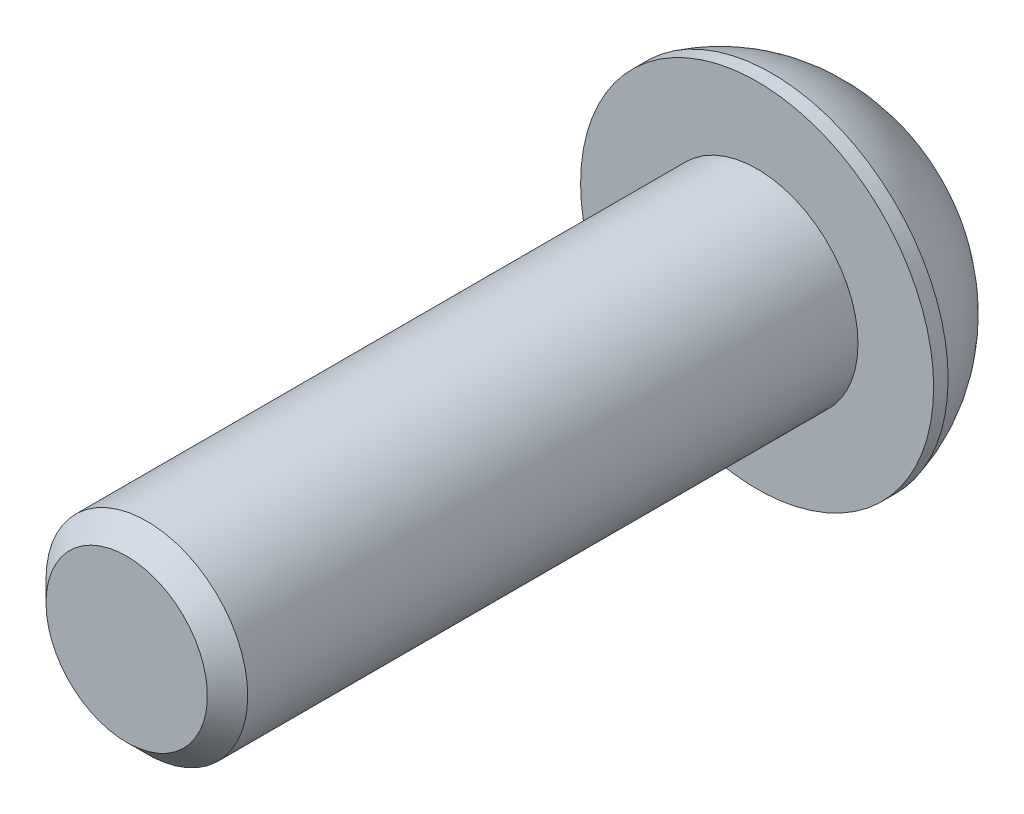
ISO-10303-21;
HEADER;
FILE_DESCRIPTION(('STEP AP214'),'2;1');
FILE_NAME('part.step','',(''),(''),'','','');
FILE_SCHEMA(('AUTOMOTIVE_DESIGN { 1 0 10303 214 1 1 1 1 }'));
ENDSEC;
DATA;
#1=APPLICATION_CONTEXT('core data for automotive mechanical design processes');
#2=APPLICATION_PROTOCOL_DEFINITION('international standard','automotive_design',2000,#1);
#3=PRODUCT_CONTEXT('',#1,'mechanical');
#4=PRODUCT('Part','Part','',(#3));
#5=PRODUCT_RELATED_PRODUCT_CATEGORY('part','',(#4));
#6=PRODUCT_DEFINITION_FORMATION('','',#4);
#7=PRODUCT_DEFINITION_CONTEXT('part definition',#1,'design');
#8=PRODUCT_DEFINITION('design','',#6,#7);
#9=PRODUCT_DEFINITION_SHAPE('','',#8);
#10=(LENGTH_UNIT() NAMED_UNIT(*) SI_UNIT(.MILLI.,.METRE.));
#11=(NAMED_UNIT(*) PLANE_ANGLE_UNIT() SI_UNIT($,.RADIAN.));
#12=(NAMED_UNIT(*) SI_UNIT($,.STERADIAN.) SOLID_ANGLE_UNIT());
#13=UNCERTAINTY_MEASURE_WITH_UNIT(LENGTH_MEASURE(1.E-05),#10,'distance_accuracy_value','');
#14=(GEOMETRIC_REPRESENTATION_CONTEXT(3) GLOBAL_UNCERTAINTY_ASSIGNED_CONTEXT((#13)) GLOBAL_UNIT_ASSIGNED_CONTEXT((#10,
#11,#12)) REPRESENTATION_CONTEXT('',''));
#15=CARTESIAN_POINT('',(0.,0.,0.));
#16=DIRECTION('',(0.,0.,1.));
#17=DIRECTION('',(1.,0.,0.));
#18=AXIS2_PLACEMENT_3D('',#15,#16,#17);
#19=CARTESIAN_POINT('',(0.,0.,-4.4));
#20=DIRECTION('',(0.,0.,1.));
#21=DIRECTION('',(1.,0.,0.));
#22=AXIS2_PLACEMENT_3D('',#19,#20,#21);
#23=PLANE('',#22);
#24=CARTESIAN_POINT('',(0.,0.,-4.4));
#25=DIRECTION('',(0.,0.,-1.));
#26=DIRECTION('',(-1.,0.,0.));
#27=AXIS2_PLACEMENT_3D('',#24,#25,#26);
#28=CIRCLE('',#27,4.06492341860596);
#29=CARTESIAN_POINT('',(-4.06492341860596,0.,-4.4));
#30=VERTEX_POINT('',#29);
#31=EDGE_CURVE('E147',#30,#30,#28,.T.);
#32=ORIENTED_EDGE('',*,*,#31,.T.);
#33=EDGE_LOOP('',(#32));
#34=FACE_BOUND('',#33,.T.);
#35=DIRECTION('',(-0.86602540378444,0.499999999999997,0.));
#36=VECTOR('',#35,1.);
#37=CARTESIAN_POINT('',(0.,2.88675134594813,-4.4));
#38=LINE('',#37,#36);
#39=CARTESIAN_POINT('',(2.5,1.44337567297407,-4.4));
#40=VERTEX_POINT('',#39);
#41=CARTESIAN_POINT('',(0.,2.88675134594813,-4.4));
#42=VERTEX_POINT('',#41);
#43=EDGE_CURVE('E49',#40,#42,#38,.T.);
#44=ORIENTED_EDGE('',*,*,#43,.T.);
#45=DIRECTION('',(-0.866025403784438,-0.500000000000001,0.));
#46=VECTOR('',#45,1.);
#47=CARTESIAN_POINT('',(0.,2.88675134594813,-4.4));
#48=LINE('',#47,#46);
#49=CARTESIAN_POINT('',(-2.5,1.44337567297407,-4.4));
#50=VERTEX_POINT('',#49);
#51=EDGE_CURVE('E120',#42,#50,#48,.T.);
#52=ORIENTED_EDGE('',*,*,#51,.T.);
#53=DIRECTION('',(0.,-1.,0.));
#54=VECTOR('',#53,1.);
#55=CARTESIAN_POINT('',(-2.5,-1.44337567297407,-4.4));
#56=LINE('',#55,#54);
#57=CARTESIAN_POINT('',(-2.5,-1.44337567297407,-4.4));
#58=VERTEX_POINT('',#57);
#59=EDGE_CURVE('E124',#50,#58,#56,.T.);
#60=ORIENTED_EDGE('',*,*,#59,.T.);
#61=DIRECTION('',(0.866025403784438,-0.500000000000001,0.));
#62=VECTOR('',#61,1.);
#63=CARTESIAN_POINT('',(0.,-2.88675134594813,-4.4));
#64=LINE('',#63,#62);
#65=CARTESIAN_POINT('',(0.,-2.88675134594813,-4.4));
#66=VERTEX_POINT('',#65);
#67=EDGE_CURVE('E127',#58,#66,#64,.T.);
#68=ORIENTED_EDGE('',*,*,#67,.T.);
#69=DIRECTION('',(0.86602540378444,0.499999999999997,0.));
#70=VECTOR('',#69,1.);
#71=CARTESIAN_POINT('',(0.,-2.88675134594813,-4.4));
#72=LINE('',#71,#70);
#73=CARTESIAN_POINT('',(2.5,-1.44337567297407,-4.4));
#74=VERTEX_POINT('',#73);
#75=EDGE_CURVE('E110',#66,#74,#72,.T.);
#76=ORIENTED_EDGE('',*,*,#75,.T.);
#77=DIRECTION('',(0.,1.,0.));
#78=VECTOR('',#77,1.);
#79=CARTESIAN_POINT('',(2.5,-1.44337567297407,-4.4));
#80=LINE('',#79,#78);
#81=EDGE_CURVE('E130',#74,#40,#80,.T.);
#82=ORIENTED_EDGE('',*,*,#81,.T.);
#83=EDGE_LOOP('',(#44,#52,#60,#68,#76,#82));
#84=FACE_BOUND('',#83,.T.);
#85=ADVANCED_FACE('F34',(#34,#84),#23,.F.);
#86=CARTESIAN_POINT('',(0.,0.,1.05548398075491));
#87=DIRECTION('',(0.,0.,-1.));
#88=DIRECTION('',(-1.,0.,0.));
#89=AXIS2_PLACEMENT_3D('',#86,#87,#88);
#90=DEGENERATE_TOROIDAL_SURFACE('',#89,0.915198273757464,6.29945028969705,.T.);
#91=ORIENTED_EDGE('',*,*,#31,.F.);
#92=EDGE_LOOP('',(#91));
#93=FACE_BOUND('',#92,.T.);
#94=CARTESIAN_POINT('',(0.,0.,-0.574933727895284));
#95=DIRECTION('',(0.,0.,-1.));
#96=DIRECTION('',(-1.,0.,0.));
#97=AXIS2_PLACEMENT_3D('',#94,#95,#96);
#98=CIRCLE('',#97,7.);
#99=CARTESIAN_POINT('',(-7.,0.,-0.574933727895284));
#100=VERTEX_POINT('',#99);
#101=EDGE_CURVE('E144',#100,#100,#98,.T.);
#102=ORIENTED_EDGE('',*,*,#101,.T.);
#103=EDGE_LOOP('',(#102));
#104=FACE_BOUND('',#103,.T.);
#105=ADVANCED_FACE('F164',(#93,#104),#90,.T.);
#106=CARTESIAN_POINT('',(0.,0.,0.));
#107=DIRECTION('',(0.,0.,-1.));
#108=DIRECTION('',(-1.,0.,0.));
#109=AXIS2_PLACEMENT_3D('',#106,#107,#108);
#110=CYLINDRICAL_SURFACE('',#109,7.);
#111=ORIENTED_EDGE('',*,*,#101,.F.);
#112=EDGE_LOOP('',(#111));
#113=FACE_BOUND('',#112,.T.);
#114=CARTESIAN_POINT('',(0.,0.,0.));
#115=DIRECTION('',(0.,0.,-1.));
#116=DIRECTION('',(-1.,0.,0.));
#117=AXIS2_PLACEMENT_3D('',#114,#115,#116);
#118=CIRCLE('',#117,7.);
#119=CARTESIAN_POINT('',(-7.,0.,0.));
#120=VERTEX_POINT('',#119);
#121=EDGE_CURVE('E141',#120,#120,#118,.T.);
#122=ORIENTED_EDGE('',*,*,#121,.T.);
#123=EDGE_LOOP('',(#122));
#124=FACE_BOUND('',#123,.T.);
#125=ADVANCED_FACE('F169',(#113,#124),#110,.T.);
#126=CARTESIAN_POINT('',(0.,0.,0.));
#127=DIRECTION('',(0.,0.,-1.));
#128=DIRECTION('',(-1.,0.,0.));
#129=AXIS2_PLACEMENT_3D('',#126,#127,#128);
#130=PLANE('',#129);
#131=CARTESIAN_POINT('',(0.,0.,0.));
#132=DIRECTION('',(0.,0.,1.));
#133=DIRECTION('',(1.,0.,0.));
#134=AXIS2_PLACEMENT_3D('',#131,#132,#133);
#135=CIRCLE('',#134,4.);
#136=CARTESIAN_POINT('',(4.,0.,0.));
#137=VERTEX_POINT('',#136);
#138=EDGE_CURVE('E121',#137,#137,#135,.T.);
#139=ORIENTED_EDGE('',*,*,#138,.F.);
#140=EDGE_LOOP('',(#139));
#141=FACE_BOUND('',#140,.T.);
#142=ORIENTED_EDGE('',*,*,#121,.F.);
#143=EDGE_LOOP('',(#142));
#144=FACE_BOUND('',#143,.T.);
#145=ADVANCED_FACE('F176',(#141,#144),#130,.F.);
#146=CARTESIAN_POINT('',(0.,2.88675134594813,-1.8));
#147=DIRECTION('',(-0.499999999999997,-0.86602540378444,0.));
#148=DIRECTION('',(0.86602540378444,-0.499999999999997,0.));
#149=AXIS2_PLACEMENT_3D('',#146,#147,#148);
#150=PLANE('',#149);
#151=ORIENTED_EDGE('',*,*,#43,.F.);
#152=DIRECTION('',(0.,0.,-1.));
#153=VECTOR('',#152,1.);
#154=CARTESIAN_POINT('',(2.5,1.44337567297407,-1.8));
#155=LINE('',#154,#153);
#156=CARTESIAN_POINT('',(2.5,1.44337567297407,-1.8));
#157=VERTEX_POINT('',#156);
#158=EDGE_CURVE('E115',#157,#40,#155,.T.);
#159=ORIENTED_EDGE('',*,*,#158,.F.);
#160=DIRECTION('',(-0.86602540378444,0.499999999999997,0.));
#161=VECTOR('',#160,1.);
#162=CARTESIAN_POINT('',(0.,2.88675134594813,-1.8));
#163=LINE('',#162,#161);
#164=CARTESIAN_POINT('',(0.,2.88675134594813,-1.8));
#165=VERTEX_POINT('',#164);
#166=EDGE_CURVE('E133',#157,#165,#163,.T.);
#167=ORIENTED_EDGE('',*,*,#166,.T.);
#168=DIRECTION('',(0.,0.,-1.));
#169=VECTOR('',#168,1.);
#170=CARTESIAN_POINT('',(0.,2.88675134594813,-1.8));
#171=LINE('',#170,#169);
#172=EDGE_CURVE('E139',#165,#42,#171,.T.);
#173=ORIENTED_EDGE('',*,*,#172,.T.);
#174=EDGE_LOOP('',(#151,#159,#167,#173));
#175=FACE_BOUND('',#174,.T.);
#176=ADVANCED_FACE('F180',(#175),#150,.T.);
#177=CARTESIAN_POINT('',(0.,2.88675134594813,-1.8));
#178=DIRECTION('',(0.500000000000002,-0.866025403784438,0.));
#179=DIRECTION('',(0.866025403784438,0.500000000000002,0.));
#180=AXIS2_PLACEMENT_3D('',#177,#178,#179);
#181=PLANE('',#180);
#182=ORIENTED_EDGE('',*,*,#51,.F.);
#183=ORIENTED_EDGE('',*,*,#172,.F.);
#184=DIRECTION('',(-0.866025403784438,-0.500000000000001,0.));
#185=VECTOR('',#184,1.);
#186=CARTESIAN_POINT('',(0.,2.88675134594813,-1.8));
#187=LINE('',#186,#185);
#188=CARTESIAN_POINT('',(-2.5,1.44337567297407,-1.8));
#189=VERTEX_POINT('',#188);
#190=EDGE_CURVE('E88',#165,#189,#187,.T.);
#191=ORIENTED_EDGE('',*,*,#190,.T.);
#192=DIRECTION('',(0.,0.,-1.));
#193=VECTOR('',#192,1.);
#194=CARTESIAN_POINT('',(-2.5,1.44337567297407,-1.8));
#195=LINE('',#194,#193);
#196=EDGE_CURVE('E137',#189,#50,#195,.T.);
#197=ORIENTED_EDGE('',*,*,#196,.T.);
#198=EDGE_LOOP('',(#182,#183,#191,#197));
#199=FACE_BOUND('',#198,.T.);
#200=ADVANCED_FACE('F184',(#199),#181,.T.);
#201=CARTESIAN_POINT('',(-2.5,-1.44337567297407,-1.8));
#202=DIRECTION('',(1.,0.,0.));
#203=DIRECTION('',(0.,0.,-1.));
#204=AXIS2_PLACEMENT_3D('',#201,#202,#203);
#205=PLANE('',#204);
#206=ORIENTED_EDGE('',*,*,#59,.F.);
#207=ORIENTED_EDGE('',*,*,#196,.F.);
#208=DIRECTION('',(0.,-1.,0.));
#209=VECTOR('',#208,1.);
#210=CARTESIAN_POINT('',(-2.5,-1.44337567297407,-1.8));
#211=LINE('',#210,#209);
#212=CARTESIAN_POINT('',(-2.5,-1.44337567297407,-1.8));
#213=VERTEX_POINT('',#212);
#214=EDGE_CURVE('E106',#189,#213,#211,.T.);
#215=ORIENTED_EDGE('',*,*,#214,.T.);
#216=DIRECTION('',(0.,0.,-1.));
#217=VECTOR('',#216,1.);
#218=CARTESIAN_POINT('',(-2.5,-1.44337567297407,-1.8));
#219=LINE('',#218,#217);
#220=EDGE_CURVE('E103',#213,#58,#219,.T.);
#221=ORIENTED_EDGE('',*,*,#220,.T.);
#222=EDGE_LOOP('',(#206,#207,#215,#221));
#223=FACE_BOUND('',#222,.T.);
#224=ADVANCED_FACE('F187',(#223),#205,.T.);
#225=CARTESIAN_POINT('',(0.,-2.88675134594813,-1.8));
#226=DIRECTION('',(0.500000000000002,0.866025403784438,0.));
#227=DIRECTION('',(-0.866025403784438,0.500000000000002,0.));
#228=AXIS2_PLACEMENT_3D('',#225,#226,#227);
#229=PLANE('',#228);
#230=ORIENTED_EDGE('',*,*,#67,.F.);
#231=ORIENTED_EDGE('',*,*,#220,.F.);
#232=DIRECTION('',(0.866025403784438,-0.500000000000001,0.));
#233=VECTOR('',#232,1.);
#234=CARTESIAN_POINT('',(0.,-2.88675134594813,-1.8));
#235=LINE('',#234,#233);
#236=CARTESIAN_POINT('',(0.,-2.88675134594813,-1.8));
#237=VERTEX_POINT('',#236);
#238=EDGE_CURVE('E98',#213,#237,#235,.T.);
#239=ORIENTED_EDGE('',*,*,#238,.T.);
#240=DIRECTION('',(0.,0.,-1.));
#241=VECTOR('',#240,1.);
#242=CARTESIAN_POINT('',(0.,-2.88675134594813,-1.8));
#243=LINE('',#242,#241);
#244=EDGE_CURVE('E102',#237,#66,#243,.T.);
#245=ORIENTED_EDGE('',*,*,#244,.T.);
#246=EDGE_LOOP('',(#230,#231,#239,#245));
#247=FACE_BOUND('',#246,.T.);
#248=ADVANCED_FACE('F101',(#247),#229,.T.);
#249=CARTESIAN_POINT('',(0.,-2.88675134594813,-1.8));
#250=DIRECTION('',(-0.499999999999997,0.86602540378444,0.));
#251=DIRECTION('',(-0.86602540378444,-0.499999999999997,0.));
#252=AXIS2_PLACEMENT_3D('',#249,#250,#251);
#253=PLANE('',#252);
#254=ORIENTED_EDGE('',*,*,#75,.F.);
#255=ORIENTED_EDGE('',*,*,#244,.F.);
#256=DIRECTION('',(0.86602540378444,0.499999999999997,0.));
#257=VECTOR('',#256,1.);
#258=CARTESIAN_POINT('',(0.,-2.88675134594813,-1.8));
#259=LINE('',#258,#257);
#260=CARTESIAN_POINT('',(2.5,-1.44337567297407,-1.8));
#261=VERTEX_POINT('',#260);
#262=EDGE_CURVE('E105',#237,#261,#259,.T.);
#263=ORIENTED_EDGE('',*,*,#262,.T.);
#264=DIRECTION('',(0.,0.,-1.));
#265=VECTOR('',#264,1.);
#266=CARTESIAN_POINT('',(2.5,-1.44337567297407,-1.8));
#267=LINE('',#266,#265);
#268=EDGE_CURVE('E79',#261,#74,#267,.T.);
#269=ORIENTED_EDGE('',*,*,#268,.T.);
#270=EDGE_LOOP('',(#254,#255,#263,#269));
#271=FACE_BOUND('',#270,.T.);
#272=ADVANCED_FACE('F108',(#271),#253,.T.);
#273=CARTESIAN_POINT('',(2.5,-1.44337567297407,-1.8));
#274=DIRECTION('',(-1.,0.,0.));
#275=DIRECTION('',(0.,0.,1.));
#276=AXIS2_PLACEMENT_3D('',#273,#274,#275);
#277=PLANE('',#276);
#278=ORIENTED_EDGE('',*,*,#81,.F.);
#279=ORIENTED_EDGE('',*,*,#268,.F.);
#280=DIRECTION('',(0.,1.,0.));
#281=VECTOR('',#280,1.);
#282=CARTESIAN_POINT('',(2.5,-1.44337567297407,-1.8));
#283=LINE('',#282,#281);
#284=EDGE_CURVE('E57',#261,#157,#283,.T.);
#285=ORIENTED_EDGE('',*,*,#284,.T.);
#286=ORIENTED_EDGE('',*,*,#158,.T.);
#287=EDGE_LOOP('',(#278,#279,#285,#286));
#288=FACE_BOUND('',#287,.T.);
#289=ADVANCED_FACE('F196',(#288),#277,.T.);
#290=CARTESIAN_POINT('',(2.5,1.44337567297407,-1.8));
#291=DIRECTION('',(0.,0.,1.));
#292=DIRECTION('',(1.,0.,0.));
#293=AXIS2_PLACEMENT_3D('',#290,#291,#292);
#294=PLANE('',#293);
#295=ORIENTED_EDGE('',*,*,#166,.F.);
#296=ORIENTED_EDGE('',*,*,#284,.F.);
#297=ORIENTED_EDGE('',*,*,#262,.F.);
#298=ORIENTED_EDGE('',*,*,#238,.F.);
#299=ORIENTED_EDGE('',*,*,#214,.F.);
#300=ORIENTED_EDGE('',*,*,#190,.F.);
#301=EDGE_LOOP('',(#295,#296,#297,#298,#299,#300));
#302=FACE_BOUND('',#301,.T.);
#303=ADVANCED_FACE('F113',(#302),#294,.F.);
#304=CARTESIAN_POINT('',(0.,0.,25.));
#305=DIRECTION('',(0.,0.,1.));
#306=DIRECTION('',(1.,0.,0.));
#307=AXIS2_PLACEMENT_3D('',#304,#305,#306);
#308=PLANE('',#307);
#309=CARTESIAN_POINT('',(0.,0.,25.));
#310=DIRECTION('',(0.,0.,1.));
#311=DIRECTION('',(1.,0.,0.));
#312=AXIS2_PLACEMENT_3D('',#309,#310,#311);
#313=CIRCLE('',#312,3.2);
#314=CARTESIAN_POINT('',(-3.2,0.,25.));
#315=VERTEX_POINT('',#314);
#316=EDGE_CURVE('E42',#315,#315,#313,.T.);
#317=ORIENTED_EDGE('',*,*,#316,.T.);
#318=EDGE_LOOP('',(#317));
#319=FACE_BOUND('',#318,.T.);
#320=ADVANCED_FACE('F152',(#319),#308,.T.);
#321=CARTESIAN_POINT('',(0.,0.,0.));
#322=DIRECTION('',(0.,0.,1.));
#323=DIRECTION('',(1.,0.,0.));
#324=AXIS2_PLACEMENT_3D('',#321,#322,#323);
#325=CYLINDRICAL_SURFACE('',#324,4.);
#326=CARTESIAN_POINT('',(0.,0.,24.2));
#327=DIRECTION('',(0.,0.,1.));
#328=DIRECTION('',(1.,0.,0.));
#329=AXIS2_PLACEMENT_3D('',#326,#327,#328);
#330=CIRCLE('',#329,4.);
#331=CARTESIAN_POINT('',(-3.99999999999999,0.,24.2));
#332=VERTEX_POINT('',#331);
#333=EDGE_CURVE('E11',#332,#332,#330,.F.);
#334=ORIENTED_EDGE('',*,*,#333,.T.);
#335=EDGE_LOOP('',(#334));
#336=FACE_BOUND('',#335,.T.);
#337=ORIENTED_EDGE('',*,*,#138,.T.);
#338=EDGE_LOOP('',(#337));
#339=FACE_BOUND('',#338,.T.);
#340=ADVANCED_FACE('F155',(#336,#339),#325,.T.);
#341=CARTESIAN_POINT('',(0.,0.,25.));
#342=DIRECTION('',(0.,0.,-1.));
#343=DIRECTION('',(-1.,0.,0.));
#344=AXIS2_PLACEMENT_3D('',#341,#342,#343);
#345=CONICAL_SURFACE('',#344,3.2,0.785398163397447);
#346=CARTESIAN_POINT('',(-3.99999999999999,0.,24.2));
#347=CARTESIAN_POINT('',(-3.99166666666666,0.,24.2083333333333));
#348=CARTESIAN_POINT('',(-3.98333333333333,0.,24.2166666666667));
#349=CARTESIAN_POINT('',(-3.96666666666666,0.,24.2333333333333));
#350=CARTESIAN_POINT('',(-3.95833333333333,0.,24.2416666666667));
#351=CARTESIAN_POINT('',(-3.94166666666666,0.,24.2583333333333));
#352=CARTESIAN_POINT('',(-3.93333333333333,0.,24.2666666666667));
#353=CARTESIAN_POINT('',(-3.91666666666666,0.,24.2833333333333));
#354=CARTESIAN_POINT('',(-3.90833333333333,0.,24.2916666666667));
#355=CARTESIAN_POINT('',(-3.89166666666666,0.,24.3083333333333));
#356=CARTESIAN_POINT('',(-3.88333333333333,0.,24.3166666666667));
#357=CARTESIAN_POINT('',(-3.86666666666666,0.,24.3333333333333));
#358=CARTESIAN_POINT('',(-3.85833333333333,0.,24.3416666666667));
#359=CARTESIAN_POINT('',(-3.84166666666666,0.,24.3583333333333));
#360=CARTESIAN_POINT('',(-3.83333333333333,0.,24.3666666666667));
#361=CARTESIAN_POINT('',(-3.81666666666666,0.,24.3833333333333));
#362=CARTESIAN_POINT('',(-3.80833333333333,0.,24.3916666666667));
#363=CARTESIAN_POINT('',(-3.79166666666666,0.,24.4083333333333));
#364=CARTESIAN_POINT('',(-3.78333333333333,0.,24.4166666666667));
#365=CARTESIAN_POINT('',(-3.76666666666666,0.,24.4333333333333));
#366=CARTESIAN_POINT('',(-3.75833333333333,0.,24.4416666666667));
#367=CARTESIAN_POINT('',(-3.74166666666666,0.,24.4583333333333));
#368=CARTESIAN_POINT('',(-3.73333333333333,0.,24.4666666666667));
#369=CARTESIAN_POINT('',(-3.71666666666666,0.,24.4833333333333));
#370=CARTESIAN_POINT('',(-3.70833333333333,0.,24.4916666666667));
#371=CARTESIAN_POINT('',(-3.69166666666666,0.,24.5083333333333));
#372=CARTESIAN_POINT('',(-3.68333333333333,0.,24.5166666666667));
#373=CARTESIAN_POINT('',(-3.66666666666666,0.,24.5333333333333));
#374=CARTESIAN_POINT('',(-3.65833333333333,0.,24.5416666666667));
#375=CARTESIAN_POINT('',(-3.64166666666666,0.,24.5583333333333));
#376=CARTESIAN_POINT('',(-3.63333333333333,0.,24.5666666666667));
#377=CARTESIAN_POINT('',(-3.61666666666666,0.,24.5833333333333));
#378=CARTESIAN_POINT('',(-3.60833333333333,0.,24.5916666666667));
#379=CARTESIAN_POINT('',(-3.59166666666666,0.,24.6083333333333));
#380=CARTESIAN_POINT('',(-3.58333333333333,0.,24.6166666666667));
#381=CARTESIAN_POINT('',(-3.56666666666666,0.,24.6333333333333));
#382=CARTESIAN_POINT('',(-3.55833333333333,0.,24.6416666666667));
#383=CARTESIAN_POINT('',(-3.54166666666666,0.,24.6583333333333));
#384=CARTESIAN_POINT('',(-3.53333333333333,0.,24.6666666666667));
#385=CARTESIAN_POINT('',(-3.51666666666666,0.,24.6833333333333));
#386=CARTESIAN_POINT('',(-3.50833333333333,0.,24.6916666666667));
#387=CARTESIAN_POINT('',(-3.49166666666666,0.,24.7083333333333));
#388=CARTESIAN_POINT('',(-3.48333333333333,0.,24.7166666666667));
#389=CARTESIAN_POINT('',(-3.46666666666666,0.,24.7333333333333));
#390=CARTESIAN_POINT('',(-3.45833333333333,0.,24.7416666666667));
#391=CARTESIAN_POINT('',(-3.44166666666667,0.,24.7583333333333));
#392=CARTESIAN_POINT('',(-3.43333333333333,0.,24.7666666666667));
#393=CARTESIAN_POINT('',(-3.41666666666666,0.,24.7833333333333));
#394=CARTESIAN_POINT('',(-3.40833333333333,0.,24.7916666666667));
#395=CARTESIAN_POINT('',(-3.39166666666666,0.,24.8083333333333));
#396=CARTESIAN_POINT('',(-3.38333333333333,0.,24.8166666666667));
#397=CARTESIAN_POINT('',(-3.36666666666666,0.,24.8333333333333));
#398=CARTESIAN_POINT('',(-3.35833333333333,0.,24.8416666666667));
#399=CARTESIAN_POINT('',(-3.34166666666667,0.,24.8583333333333));
#400=CARTESIAN_POINT('',(-3.33333333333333,0.,24.8666666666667));
#401=CARTESIAN_POINT('',(-3.31666666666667,0.,24.8833333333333));
#402=CARTESIAN_POINT('',(-3.30833333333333,0.,24.8916666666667));
#403=CARTESIAN_POINT('',(-3.29166666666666,0.,24.9083333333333));
#404=CARTESIAN_POINT('',(-3.28333333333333,0.,24.9166666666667));
#405=CARTESIAN_POINT('',(-3.26666666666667,0.,24.9333333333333));
#406=CARTESIAN_POINT('',(-3.25833333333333,0.,24.9416666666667));
#407=CARTESIAN_POINT('',(-3.24166666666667,0.,24.9583333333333));
#408=CARTESIAN_POINT('',(-3.23333333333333,0.,24.9666666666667));
#409=CARTESIAN_POINT('',(-3.21666666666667,0.,24.9833333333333));
#410=CARTESIAN_POINT('',(-3.20833333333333,0.,24.9916666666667));
#411=CARTESIAN_POINT('',(-3.2,0.,25.));
#412=B_SPLINE_CURVE_WITH_KNOTS('',3,(#346,#347,#348,#349,#350,#351,#352,#353,#354,#355,#356,
#357,#358,#359,#360,#361,#362,#363,#364,#365,#366,#367,#368,#369,#370,#371,#372,#373,#374,#375,
#376,#377,#378,#379,#380,#381,#382,#383,#384,#385,#386,#387,#388,#389,#390,#391,#392,#393,#394,
#395,#396,#397,#398,#399,#400,#401,#402,#403,#404,#405,#406,#407,#408,#409,#410,#411),
.UNSPECIFIED.,.F.,.F.,(4,2,2,2,2,2,2,2,2,2,2,2,2,2,2,2,2,2,2,2,2,2,2,2,2,2,2,2,2,2,2,2,4),(0.,
0.0353553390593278,0.0707106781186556,0.106066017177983,0.141421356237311,0.176776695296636,
0.212132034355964,0.247487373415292,0.28284271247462,0.318198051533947,0.353553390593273,
0.388908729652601,0.424264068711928,0.459619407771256,0.494974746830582,0.530330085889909,
0.565685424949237,0.601040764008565,0.636396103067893,0.671751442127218,0.707106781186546,
0.742462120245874,0.777817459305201,0.813172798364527,0.848528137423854,0.883883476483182,
0.91923881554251,0.954594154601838,0.989949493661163,1.02530483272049,1.06066017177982,
1.09601551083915,1.13137084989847),.UNSPECIFIED.);
#413=EDGE_CURVE('BSEAM36',#332,#315,#412,.T.);
#414=ORIENTED_EDGE('',*,*,#333,.F.);
#415=ORIENTED_EDGE('',*,*,#316,.F.);
#416=ORIENTED_EDGE('',*,*,#413,.T.);
#417=ORIENTED_EDGE('',*,*,#413,.F.);
#418=EDGE_LOOP('',(#414,#416,#415,#417));
#419=FACE_BOUND('',#418,.T.);
#420=ADVANCED_FACE('F36',(#419),#345,.T.);
#421=CLOSED_SHELL('',(#85,#105,#125,#145,#176,#200,#224,#248,#272,#289,#303,#320,#340,#420));
#422=MANIFOLD_SOLID_BREP('B2',#421);
#423=ADVANCED_BREP_SHAPE_REPRESENTATION('',(#18,#422),#14);
#424=SHAPE_DEFINITION_REPRESENTATION(#9,#423);
ENDSEC;
END-ISO-10303-21;
